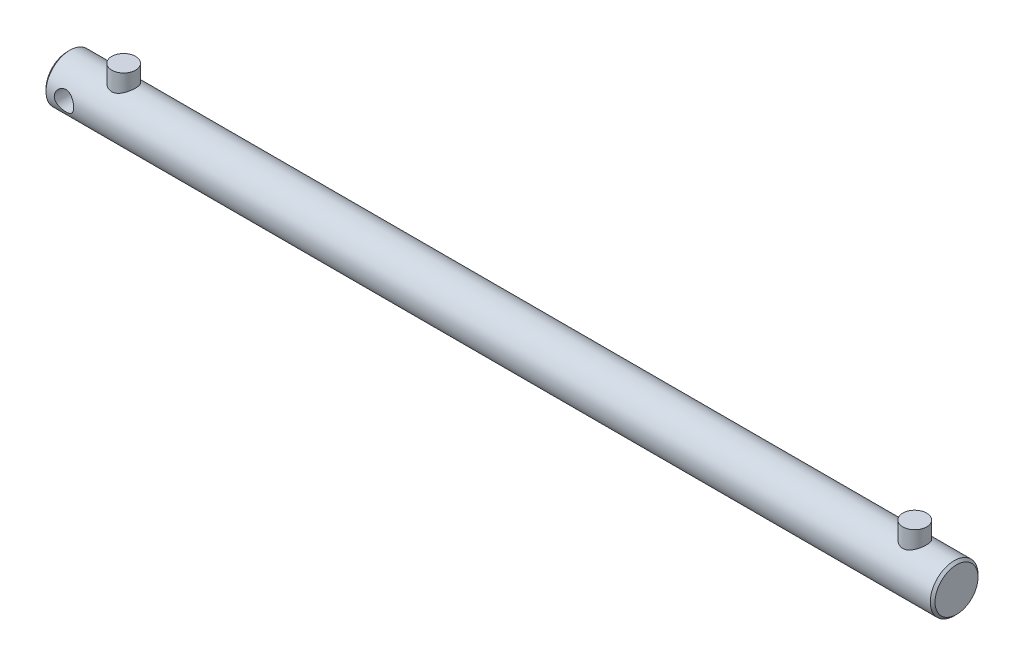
ISO-10303-21;
HEADER;
FILE_DESCRIPTION(('STEP AP214'),'2;1');
FILE_NAME('part.step','',(''),(''),'','','');
FILE_SCHEMA(('AUTOMOTIVE_DESIGN { 1 0 10303 214 1 1 1 1 }'));
ENDSEC;
DATA;
#1=APPLICATION_CONTEXT('core data for automotive mechanical design processes');
#2=APPLICATION_PROTOCOL_DEFINITION('international standard','automotive_design',2000,#1);
#3=PRODUCT_CONTEXT('',#1,'mechanical');
#4=PRODUCT('Part','Part','',(#3));
#5=PRODUCT_RELATED_PRODUCT_CATEGORY('part','',(#4));
#6=PRODUCT_DEFINITION_FORMATION('','',#4);
#7=PRODUCT_DEFINITION_CONTEXT('part definition',#1,'design');
#8=PRODUCT_DEFINITION('design','',#6,#7);
#9=PRODUCT_DEFINITION_SHAPE('','',#8);
#10=(LENGTH_UNIT() NAMED_UNIT(*) SI_UNIT(.MILLI.,.METRE.));
#11=(NAMED_UNIT(*) PLANE_ANGLE_UNIT() SI_UNIT($,.RADIAN.));
#12=(NAMED_UNIT(*) SI_UNIT($,.STERADIAN.) SOLID_ANGLE_UNIT());
#13=UNCERTAINTY_MEASURE_WITH_UNIT(LENGTH_MEASURE(1.E-05),#10,'distance_accuracy_value','');
#14=(GEOMETRIC_REPRESENTATION_CONTEXT(3) GLOBAL_UNCERTAINTY_ASSIGNED_CONTEXT((#13)) GLOBAL_UNIT_ASSIGNED_CONTEXT((#10,
#11,#12)) REPRESENTATION_CONTEXT('',''));
#15=CARTESIAN_POINT('',(0.,0.,0.));
#16=DIRECTION('',(0.,0.,1.));
#17=DIRECTION('',(1.,0.,0.));
#18=AXIS2_PLACEMENT_3D('',#15,#16,#17);
#19=CARTESIAN_POINT('',(-372.,0.,0.));
#20=DIRECTION('',(-1.,0.,0.));
#21=DIRECTION('',(0.,0.,1.));
#22=AXIS2_PLACEMENT_3D('',#19,#20,#21);
#23=CYLINDRICAL_SURFACE('',#22,20.);
#24=CARTESIAN_POINT('',(-325.,17.3205080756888,-10.));
#25=CARTESIAN_POINT('',(-325.260663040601,17.3205095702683,-9.99999887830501));
#26=CARTESIAN_POINT('',(-325.521348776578,17.3264124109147,-9.98979463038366));
#27=CARTESIAN_POINT('',(-326.040711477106,17.3498046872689,-9.94911125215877));
#28=CARTESIAN_POINT('',(-326.299387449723,17.3672995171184,-9.9186226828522));
#29=CARTESIAN_POINT('',(-326.813023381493,17.4132568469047,-9.83771551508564));
#30=CARTESIAN_POINT('',(-327.06797685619,17.4417365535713,-9.7872656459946));
#31=CARTESIAN_POINT('',(-327.572049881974,17.5086546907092,-9.66704369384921));
#32=CARTESIAN_POINT('',(-327.821166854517,17.5470974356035,-9.59726323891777));
#33=CARTESIAN_POINT('',(-328.310473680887,17.6323996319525,-9.43962165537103));
#34=CARTESIAN_POINT('',(-328.550706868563,17.6792090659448,-9.35186754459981));
#35=CARTESIAN_POINT('',(-329.022554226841,17.779982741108,-9.15882440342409));
#36=CARTESIAN_POINT('',(-329.254165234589,17.8339495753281,-9.05352901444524));
#37=CARTESIAN_POINT('',(-329.707545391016,17.9475017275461,-8.82628481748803));
#38=CARTESIAN_POINT('',(-329.929316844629,18.0070857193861,-8.70433993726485));
#39=CARTESIAN_POINT('',(-330.362159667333,18.1303531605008,-8.44458163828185));
#40=CARTESIAN_POINT('',(-330.573230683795,18.1940367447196,-8.30676769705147));
#41=CARTESIAN_POINT('',(-331.000837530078,18.329363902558,-8.00400718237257));
#42=CARTESIAN_POINT('',(-331.216382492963,18.4012302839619,-7.83775940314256));
#43=CARTESIAN_POINT('',(-331.632934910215,18.5460965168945,-7.48852658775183));
#44=CARTESIAN_POINT('',(-331.833946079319,18.6190960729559,-7.30554585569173));
#45=CARTESIAN_POINT('',(-332.220694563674,18.7644955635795,-6.92354675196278));
#46=CARTESIAN_POINT('',(-332.406419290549,18.836894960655,-6.72451542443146));
#47=CARTESIAN_POINT('',(-332.761346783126,18.9792540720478,-6.31154503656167));
#48=CARTESIAN_POINT('',(-332.930555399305,19.0492146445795,-6.09761130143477));
#49=CARTESIAN_POINT('',(-333.262364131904,19.1896470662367,-5.64077435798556));
#50=CARTESIAN_POINT('',(-333.423739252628,19.2598322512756,-5.39689043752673));
#51=CARTESIAN_POINT('',(-333.725206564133,19.3935808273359,-4.89454568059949));
#52=CARTESIAN_POINT('',(-333.865297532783,19.4571438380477,-4.63608400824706));
#53=CARTESIAN_POINT('',(-334.122748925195,19.5757886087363,-4.10635184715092));
#54=CARTESIAN_POINT('',(-334.240120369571,19.6308744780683,-3.83508764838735));
#55=CARTESIAN_POINT('',(-334.450862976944,19.7309453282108,-3.28159286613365));
#56=CARTESIAN_POINT('',(-334.544236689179,19.775931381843,-2.99936345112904));
#57=CARTESIAN_POINT('',(-334.700028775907,19.8516061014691,-2.44661617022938));
#58=CARTESIAN_POINT('',(-334.764176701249,19.8830841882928,-2.1766933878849));
#59=CARTESIAN_POINT('',(-334.869930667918,19.9352303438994,-1.63143316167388));
#60=CARTESIAN_POINT('',(-334.911537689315,19.9558988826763,-1.35609595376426));
#61=CARTESIAN_POINT('',(-334.971639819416,19.9858180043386,-0.802434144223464));
#62=CARTESIAN_POINT('',(-334.990146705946,19.9950744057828,-0.524111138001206));
#63=CARTESIAN_POINT('',(-335.003828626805,20.001913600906,0.0332441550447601));
#64=CARTESIAN_POINT('',(-334.999005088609,19.9994971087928,0.312276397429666));
#65=CARTESIAN_POINT('',(-334.967536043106,19.9837839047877,0.844365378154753));
#66=CARTESIAN_POINT('',(-334.942827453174,19.9714530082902,1.0975680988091));
#67=CARTESIAN_POINT('',(-334.874317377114,19.9374335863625,1.60072224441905));
#68=CARTESIAN_POINT('',(-334.830517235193,19.9157457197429,1.85067389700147));
#69=CARTESIAN_POINT('',(-334.724300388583,19.8635314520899,2.34564683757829));
#70=CARTESIAN_POINT('',(-334.66188307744,19.8330047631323,2.59066796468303));
#71=CARTESIAN_POINT('',(-334.519069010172,19.7638249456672,3.07423071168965));
#72=CARTESIAN_POINT('',(-334.438671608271,19.7251715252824,3.31277209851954));
#73=CARTESIAN_POINT('',(-334.259427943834,19.6400278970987,3.78519130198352));
#74=CARTESIAN_POINT('',(-334.160345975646,19.5934383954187,4.01896179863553));
#75=CARTESIAN_POINT('',(-333.945309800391,19.4938328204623,4.47722728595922));
#76=CARTESIAN_POINT('',(-333.829349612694,19.4408144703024,4.70171895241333));
#77=CARTESIAN_POINT('',(-333.457485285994,19.2738101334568,5.35951935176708));
#78=CARTESIAN_POINT('',(-333.17748838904,19.1518214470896,5.77743819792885));
#79=CARTESIAN_POINT('',(-332.530959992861,18.8844067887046,6.60185513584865));
#80=CARTESIAN_POINT('',(-332.158750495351,18.7378553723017,7.00353936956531));
#81=CARTESIAN_POINT('',(-331.55536158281,18.5185765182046,7.55658054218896));
#82=CARTESIAN_POINT('',(-331.346548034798,18.4455210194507,7.73279224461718));
#83=CARTESIAN_POINT('',(-330.914677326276,18.301419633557,8.06791510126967));
#84=CARTESIAN_POINT('',(-330.691618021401,18.2303740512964,8.2268236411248));
#85=CARTESIAN_POINT('',(-330.217666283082,18.0878347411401,8.53586780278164));
#86=CARTESIAN_POINT('',(-329.965906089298,18.0166021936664,8.68479491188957));
#87=CARTESIAN_POINT('',(-329.448949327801,17.8810231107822,8.96061518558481));
#88=CARTESIAN_POINT('',(-329.183758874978,17.8166734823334,9.08751826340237));
#89=CARTESIAN_POINT('',(-328.64159710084,17.6972138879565,9.3180190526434));
#90=CARTESIAN_POINT('',(-328.364632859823,17.6420984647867,9.42163054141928));
#91=CARTESIAN_POINT('',(-327.800756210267,17.5432965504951,9.60435110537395));
#92=CARTESIAN_POINT('',(-327.513845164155,17.4996085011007,9.68346352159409));
#93=CARTESIAN_POINT('',(-326.955495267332,17.4285246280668,9.81078056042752));
#94=CARTESIAN_POINT('',(-326.684630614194,17.400112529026,9.86093677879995));
#95=CARTESIAN_POINT('',(-326.13867425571,17.355765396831,9.93878416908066));
#96=CARTESIAN_POINT('',(-325.863582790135,17.3398296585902,9.96647661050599));
#97=CARTESIAN_POINT('',(-325.311769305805,17.3211203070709,9.99895720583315));
#98=CARTESIAN_POINT('',(-325.035048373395,17.3183387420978,10.0037591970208));
#99=CARTESIAN_POINT('',(-324.482357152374,17.3260388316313,9.99041751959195));
#100=CARTESIAN_POINT('',(-324.206386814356,17.3365195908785,9.97227539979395));
#101=CARTESIAN_POINT('',(-323.687830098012,17.3684286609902,9.91658048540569));
#102=CARTESIAN_POINT('',(-323.444904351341,17.3885290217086,9.88137691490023));
#103=CARTESIAN_POINT('',(-322.963158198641,17.4382137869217,9.79342893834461));
#104=CARTESIAN_POINT('',(-322.724339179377,17.467801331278,9.7406787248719));
#105=CARTESIAN_POINT('',(-322.25237280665,17.5355331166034,9.61821012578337));
#106=CARTESIAN_POINT('',(-322.019224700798,17.5736762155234,9.54849400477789));
#107=CARTESIAN_POINT('',(-321.55977565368,17.6574071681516,9.39275103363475));
#108=CARTESIAN_POINT('',(-321.33347746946,17.7029979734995,9.30671771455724));
#109=CARTESIAN_POINT('',(-320.646161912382,17.8535843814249,9.01657018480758));
#110=CARTESIAN_POINT('',(-320.19832719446,17.9691397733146,8.78600743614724));
#111=CARTESIAN_POINT('',(-319.34518986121,18.2156365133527,8.26280380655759));
#112=CARTESIAN_POINT('',(-318.93990925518,18.3465857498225,7.9701310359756));
#113=CARTESIAN_POINT('',(-318.344589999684,18.5540860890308,7.46888401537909));
#114=CARTESIAN_POINT('',(-318.137806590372,18.6294365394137,7.27935116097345));
#115=CARTESIAN_POINT('',(-317.740757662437,18.7793184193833,6.88345408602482));
#116=CARTESIAN_POINT('',(-317.550487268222,18.8538500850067,6.6770948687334));
#117=CARTESIAN_POINT('',(-317.18740551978,19.0002370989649,6.24838707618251));
#118=CARTESIAN_POINT('',(-317.014607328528,19.0720904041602,6.02602665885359));
#119=CARTESIAN_POINT('',(-316.687849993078,19.2111944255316,5.56664786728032));
#120=CARTESIAN_POINT('',(-316.533882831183,19.2784470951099,5.32963579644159));
#121=CARTESIAN_POINT('',(-316.2420643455,19.4083463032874,4.83560208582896));
#122=CARTESIAN_POINT('',(-316.104754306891,19.4708214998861,4.57821478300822));
#123=CARTESIAN_POINT('',(-315.852529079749,19.5873354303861,4.05082787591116));
#124=CARTESIAN_POINT('',(-315.737614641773,19.6413738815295,3.78082784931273));
#125=CARTESIAN_POINT('',(-315.531567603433,19.7393769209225,3.23033940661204));
#126=CARTESIAN_POINT('',(-315.440418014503,19.7833487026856,2.94985864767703));
#127=CARTESIAN_POINT('',(-315.282980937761,19.8599022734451,2.38049331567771));
#128=CARTESIAN_POINT('',(-315.216690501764,19.8924854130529,2.09160974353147));
#129=CARTESIAN_POINT('',(-315.114810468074,19.9427983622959,1.53480500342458));
#130=CARTESIAN_POINT('',(-315.076961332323,19.9616170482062,1.26739371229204));
#131=CARTESIAN_POINT('',(-315.023013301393,19.9884894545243,0.729851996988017));
#132=CARTESIAN_POINT('',(-315.006913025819,19.9965438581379,0.459721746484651));
#133=CARTESIAN_POINT('',(-314.996673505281,20.0016629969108,-0.0809759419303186));
#134=CARTESIAN_POINT('',(-315.002527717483,19.998731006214,-0.351543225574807));
#135=CARTESIAN_POINT('',(-315.036105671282,19.9819662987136,-0.890971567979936));
#136=CARTESIAN_POINT('',(-315.063828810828,19.9681338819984,-1.15983267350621));
#137=CARTESIAN_POINT('',(-315.13824007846,19.9312153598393,-1.67605139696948));
#138=CARTESIAN_POINT('',(-315.18355535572,19.9088004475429,-1.92365683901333));
#139=CARTESIAN_POINT('',(-315.292457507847,19.8553300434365,-2.41384547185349));
#140=CARTESIAN_POINT('',(-315.356043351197,19.8242750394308,-2.65642894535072));
#141=CARTESIAN_POINT('',(-315.500847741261,19.7542370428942,-3.13506320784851));
#142=CARTESIAN_POINT('',(-315.582064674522,19.7152547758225,-3.37111459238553));
#143=CARTESIAN_POINT('',(-315.761430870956,19.6302044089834,-3.83546861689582));
#144=CARTESIAN_POINT('',(-315.859586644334,19.5841335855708,-4.06376823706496));
#145=CARTESIAN_POINT('',(-316.076518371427,19.483810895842,-4.52085803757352));
#146=CARTESIAN_POINT('',(-316.1959918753,19.4292950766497,-4.74925902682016));
#147=CARTESIAN_POINT('',(-316.451565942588,19.3148302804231,-5.1952243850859));
#148=CARTESIAN_POINT('',(-316.587672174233,19.2548794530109,-5.41278502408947));
#149=CARTESIAN_POINT('',(-316.875596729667,19.1308402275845,-5.83606045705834));
#150=CARTESIAN_POINT('',(-317.027418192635,19.0667510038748,-6.04177287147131));
#151=CARTESIAN_POINT('',(-317.345875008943,18.9358010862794,-6.44045588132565));
#152=CARTESIAN_POINT('',(-317.5125111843,18.868940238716,-6.63342576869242));
#153=CARTESIAN_POINT('',(-317.877095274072,18.7271146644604,-7.02443076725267));
#154=CARTESIAN_POINT('',(-318.076508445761,18.6520069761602,-7.22105023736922));
#155=CARTESIAN_POINT('',(-318.491110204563,18.5021161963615,-7.59688252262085));
#156=CARTESIAN_POINT('',(-318.706294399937,18.4273330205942,-7.77610015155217));
#157=CARTESIAN_POINT('',(-319.151667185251,18.2800108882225,-8.11637930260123));
#158=CARTESIAN_POINT('',(-319.381870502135,18.2074742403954,-8.27742256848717));
#159=CARTESIAN_POINT('',(-319.856021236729,18.0668000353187,-8.58012843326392));
#160=CARTESIAN_POINT('',(-320.09997058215,17.9986630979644,-8.72178830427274));
#161=CARTESIAN_POINT('',(-320.60837449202,17.8668466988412,-8.98880823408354));
#162=CARTESIAN_POINT('',(-320.873235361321,17.8033795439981,-9.11350193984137));
#163=CARTESIAN_POINT('',(-321.414528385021,17.6857538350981,-9.33972032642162));
#164=CARTESIAN_POINT('',(-321.690954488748,17.6315904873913,-9.4412569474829));
#165=CARTESIAN_POINT('',(-322.252811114,17.5348420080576,-9.61975104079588));
#166=CARTESIAN_POINT('',(-322.538216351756,17.4922271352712,-9.6967717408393));
#167=CARTESIAN_POINT('',(-323.116185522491,17.4202953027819,-9.82541504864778));
#168=CARTESIAN_POINT('',(-323.408744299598,17.3909690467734,-9.87705541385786));
#169=CARTESIAN_POINT('',(-323.917995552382,17.3529508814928,-9.94364603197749));
#170=CARTESIAN_POINT('',(-324.133648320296,17.3408143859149,-9.96475859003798));
#171=CARTESIAN_POINT('',(-324.566195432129,17.3245920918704,-9.99293651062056));
#172=CARTESIAN_POINT('',(-324.783089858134,17.3205068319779,-10.0000009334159));
#173=CARTESIAN_POINT('',(-325.,17.3205080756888,-10.));
#174=B_SPLINE_CURVE_WITH_KNOTS('',3,(#24,#25,#26,#27,#28,#29,#30,#31,#32,#33,#34,#35,#36,#37,
#38,#39,#40,#41,#42,#43,#44,#45,#46,#47,#48,#49,#50,#51,#52,#53,#54,#55,#56,#57,#58,#59,#60,#61,
#62,#63,#64,#65,#66,#67,#68,#69,#70,#71,#72,#73,#74,#75,#76,#77,#78,#79,#80,#81,#82,#83,#84,#85,
#86,#87,#88,#89,#90,#91,#92,#93,#94,#95,#96,#97,#98,#99,#100,#101,#102,#103,#104,#105,#106,#107,
#108,#109,#110,#111,#112,#113,#114,#115,#116,#117,#118,#119,#120,#121,#122,#123,#124,#125,#126,
#127,#128,#129,#130,#131,#132,#133,#134,#135,#136,#137,#138,#139,#140,#141,#142,#143,#144,#145,
#146,#147,#148,#149,#150,#151,#152,#153,#154,#155,#156,#157,#158,#159,#160,#161,#162,#163,#164,
#165,#166,#167,#168,#169,#170,#171,#172,#173),.UNSPECIFIED.,.T.,.F.,(4,2,2,2,2,2,2,2,2,2,2,2,2,
2,2,2,2,2,2,2,2,2,2,2,2,2,2,2,2,2,2,2,2,2,2,2,2,2,2,2,2,2,2,2,2,2,2,2,2,2,2,2,2,2,2,2,2,2,2,2,2,
2,2,2,2,2,2,2,2,2,2,2,2,2,4),(0.,0.781764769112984,1.56389357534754,2.34725251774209,
3.1309512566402,3.91011273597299,4.68955727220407,5.46881824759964,6.24810488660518,
7.09181817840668,7.93531505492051,8.77949974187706,9.62338430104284,10.524458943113,
11.4255853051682,12.3262734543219,13.2268658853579,14.063393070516,14.8998838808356,
15.7359480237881,16.5719610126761,17.3351709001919,18.0983270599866,18.8615080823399,
19.6247165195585,20.3982891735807,21.1721366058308,22.7189130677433,24.4119022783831,
25.2596540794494,26.1075337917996,27.0095657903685,27.9111907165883,28.8122809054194,
29.7132481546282,30.5428616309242,31.372428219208,32.2014932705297,33.0305023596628,
33.7685142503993,34.5067706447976,35.2449285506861,35.9833797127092,37.5272041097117,
39.0718230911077,39.942334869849,40.8125887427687,41.6834934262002,42.554026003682,
43.4478458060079,44.3416955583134,45.2349045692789,46.1280076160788,46.9391312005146,
47.7502033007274,48.5610337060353,49.3718417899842,50.1291222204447,50.8863599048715,
51.6435283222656,52.4009883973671,53.1905472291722,53.9803758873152,54.7703626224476,
55.5603932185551,56.4292490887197,57.2978639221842,58.1673436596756,59.0369456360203,
59.9343645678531,60.8313197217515,61.7259424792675,62.6199384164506,63.2704386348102,
63.9209823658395),.UNSPECIFIED.);
#175=CARTESIAN_POINT('',(-325.,17.3205080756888,-10.));
#176=VERTEX_POINT('',#175);
#177=EDGE_CURVE('E40',#176,#176,#174,.T.);
#178=ORIENTED_EDGE('',*,*,#177,.F.);
#179=EDGE_LOOP('',(#178));
#180=FACE_BOUND('',#179,.T.);
#181=CARTESIAN_POINT('',(-346.9,0.,-20.));
#182=CARTESIAN_POINT('',(-346.900001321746,0.217553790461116,-19.9999989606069));
#183=CARTESIAN_POINT('',(-346.908776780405,0.435188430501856,-19.9964404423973));
#184=CARTESIAN_POINT('',(-346.943798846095,0.868915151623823,-19.9822953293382));
#185=CARTESIAN_POINT('',(-346.970056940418,1.085006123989,-19.9717041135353));
#186=CARTESIAN_POINT('',(-347.039857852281,1.51445060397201,-19.9437418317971));
#187=CARTESIAN_POINT('',(-347.083440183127,1.72779669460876,-19.9263552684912));
#188=CARTESIAN_POINT('',(-347.187452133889,2.14972461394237,-19.8852614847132));
#189=CARTESIAN_POINT('',(-347.247882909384,2.35830611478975,-19.8615538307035));
#190=CARTESIAN_POINT('',(-347.384784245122,2.76859175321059,-19.8085220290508));
#191=CARTESIAN_POINT('',(-347.461199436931,2.97031690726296,-19.7792172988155));
#192=CARTESIAN_POINT('',(-347.629534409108,3.3663843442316,-19.7156711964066));
#193=CARTESIAN_POINT('',(-347.721454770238,3.56072635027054,-19.6814296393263));
#194=CARTESIAN_POINT('',(-347.920016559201,3.94078379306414,-19.6088661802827));
#195=CARTESIAN_POINT('',(-348.026649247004,4.12650426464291,-19.5705467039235));
#196=CARTESIAN_POINT('',(-348.253961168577,4.48850295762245,-19.4907084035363));
#197=CARTESIAN_POINT('',(-348.374645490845,4.66477772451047,-19.4491884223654));
#198=CARTESIAN_POINT('',(-348.63482150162,5.01438229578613,-19.3620718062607));
#199=CARTESIAN_POINT('',(-348.774904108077,5.18724787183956,-19.3163763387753));
#200=CARTESIAN_POINT('',(-349.068619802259,5.52069726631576,-19.2237314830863));
#201=CARTESIAN_POINT('',(-349.222253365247,5.6812806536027,-19.1767820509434));
#202=CARTESIAN_POINT('',(-349.542284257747,5.98938278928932,-19.0827999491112));
#203=CARTESIAN_POINT('',(-349.708689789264,6.1368930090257,-19.0357672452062));
#204=CARTESIAN_POINT('',(-350.053204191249,6.41783459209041,-18.9428953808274));
#205=CARTESIAN_POINT('',(-350.231309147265,6.55127062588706,-18.8970558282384));
#206=CARTESIAN_POINT('',(-350.606840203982,6.80914100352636,-18.8057217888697));
#207=CARTESIAN_POINT('',(-350.804779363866,6.93287030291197,-18.760342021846));
#208=CARTESIAN_POINT('',(-351.21120099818,7.16306636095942,-18.6736608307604));
#209=CARTESIAN_POINT('',(-351.419679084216,7.26954022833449,-18.6323577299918));
#210=CARTESIAN_POINT('',(-351.845884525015,7.4643447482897,-18.555175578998));
#211=CARTESIAN_POINT('',(-352.063610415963,7.55267825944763,-18.5192956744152));
#212=CARTESIAN_POINT('',(-352.506807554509,7.71033713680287,-18.4542132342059));
#213=CARTESIAN_POINT('',(-352.732278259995,7.77966383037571,-18.4250102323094));
#214=CARTESIAN_POINT('',(-353.178677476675,7.8957894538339,-18.3755355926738));
#215=CARTESIAN_POINT('',(-353.399335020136,7.94348076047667,-18.3549138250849));
#216=CARTESIAN_POINT('',(-353.844442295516,8.02032945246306,-18.321464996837));
#217=CARTESIAN_POINT('',(-354.06889191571,8.04948738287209,-18.3086377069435));
#218=CARTESIAN_POINT('',(-354.519666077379,8.08890880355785,-18.2912553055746));
#219=CARTESIAN_POINT('',(-354.745989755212,8.09918055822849,-18.2866965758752));
#220=CARTESIAN_POINT('',(-355.198709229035,8.10072505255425,-18.2860126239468));
#221=CARTESIAN_POINT('',(-355.425105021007,8.09199871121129,-18.2898869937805));
#222=CARTESIAN_POINT('',(-355.859830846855,8.05697039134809,-18.3053422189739));
#223=CARTESIAN_POINT('',(-356.068288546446,8.03197836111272,-18.3163484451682));
#224=CARTESIAN_POINT('',(-356.482250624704,7.96598244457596,-18.3451470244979));
#225=CARTESIAN_POINT('',(-356.687753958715,7.92497303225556,-18.362941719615));
#226=CARTESIAN_POINT('',(-357.094312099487,7.82735937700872,-18.4047618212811));
#227=CARTESIAN_POINT('',(-357.29536798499,7.77075896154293,-18.4287856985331));
#228=CARTESIAN_POINT('',(-357.691918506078,7.6424487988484,-18.4823647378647));
#229=CARTESIAN_POINT('',(-357.887410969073,7.57073323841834,-18.5119220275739));
#230=CARTESIAN_POINT('',(-358.275541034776,7.41119054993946,-18.5763775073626));
#231=CARTESIAN_POINT('',(-358.468040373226,7.32306621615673,-18.6113718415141));
#232=CARTESIAN_POINT('',(-358.845021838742,7.13235218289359,-18.6852885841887));
#233=CARTESIAN_POINT('',(-359.029501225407,7.02975758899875,-18.7242123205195));
#234=CARTESIAN_POINT('',(-359.389462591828,6.81080050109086,-18.8049623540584));
#235=CARTESIAN_POINT('',(-359.564943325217,6.69443610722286,-18.8467890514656));
#236=CARTESIAN_POINT('',(-359.90603190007,6.44864679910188,-18.932297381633));
#237=CARTESIAN_POINT('',(-360.071639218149,6.31922119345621,-18.9759791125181));
#238=CARTESIAN_POINT('',(-360.404955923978,6.03720358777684,-19.0676654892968));
#239=CARTESIAN_POINT('',(-360.571781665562,5.88358742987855,-19.1157372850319));
#240=CARTESIAN_POINT('',(-360.891974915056,5.56290919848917,-19.2115077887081));
#241=CARTESIAN_POINT('',(-361.045346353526,5.39585107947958,-19.2592066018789));
#242=CARTESIAN_POINT('',(-361.337835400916,5.04909074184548,-19.3530089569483));
#243=CARTESIAN_POINT('',(-361.476944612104,4.86938117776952,-19.3991115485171));
#244=CARTESIAN_POINT('',(-361.739815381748,4.49850306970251,-19.4884538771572));
#245=CARTESIAN_POINT('',(-361.86358307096,4.30733914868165,-19.5316947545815));
#246=CARTESIAN_POINT('',(-362.097369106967,3.9104365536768,-19.6150570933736));
#247=CARTESIAN_POINT('',(-362.207039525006,3.704474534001,-19.6550927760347));
#248=CARTESIAN_POINT('',(-362.408471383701,3.28314601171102,-19.729842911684));
#249=CARTESIAN_POINT('',(-362.500240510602,3.06778359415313,-19.7645596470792));
#250=CARTESIAN_POINT('',(-362.665018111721,2.62913934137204,-19.8276753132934));
#251=CARTESIAN_POINT('',(-362.738030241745,2.40585905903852,-19.8560754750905));
#252=CARTESIAN_POINT('',(-362.864528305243,1.95305901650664,-19.9057131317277));
#253=CARTESIAN_POINT('',(-362.918015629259,1.72353970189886,-19.926951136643));
#254=CARTESIAN_POINT('',(-363.002224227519,1.27415358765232,-19.9605660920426));
#255=CARTESIAN_POINT('',(-363.034125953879,1.05454166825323,-19.9734009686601));
#256=CARTESIAN_POINT('',(-363.079807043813,0.613140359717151,-19.9918193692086));
#257=CARTESIAN_POINT('',(-363.093587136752,0.391351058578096,-19.9974031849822));
#258=CARTESIAN_POINT('',(-363.102871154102,-0.0526198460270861,-20.0011625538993));
#259=CARTESIAN_POINT('',(-363.098379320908,-0.274801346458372,-19.9993398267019));
#260=CARTESIAN_POINT('',(-363.071179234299,-0.717859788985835,-19.9883410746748));
#261=CARTESIAN_POINT('',(-363.048471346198,-0.938736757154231,-19.9791651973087));
#262=CARTESIAN_POINT('',(-362.986569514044,-1.36724903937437,-19.954311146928));
#263=CARTESIAN_POINT('',(-362.948192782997,-1.5750219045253,-19.9389557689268));
#264=CARTESIAN_POINT('',(-362.855464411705,-1.98649733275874,-19.9021734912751));
#265=CARTESIAN_POINT('',(-362.801107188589,-2.19019844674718,-19.8807444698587));
#266=CARTESIAN_POINT('',(-362.676934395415,-2.59208434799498,-19.8323487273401));
#267=CARTESIAN_POINT('',(-362.607123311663,-2.79027071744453,-19.8053836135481));
#268=CARTESIAN_POINT('',(-362.452592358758,-3.18006963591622,-19.7465447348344));
#269=CARTESIAN_POINT('',(-362.367866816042,-3.37167964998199,-19.7146691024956));
#270=CARTESIAN_POINT('',(-362.181383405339,-3.75288057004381,-19.6457256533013));
#271=CARTESIAN_POINT('',(-362.079186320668,-3.94223332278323,-19.6085295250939));
#272=CARTESIAN_POINT('',(-361.860392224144,-4.3117445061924,-19.5306049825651));
#273=CARTESIAN_POINT('',(-361.743790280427,-4.4918997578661,-19.4898753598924));
#274=CARTESIAN_POINT('',(-361.496967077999,-4.84203534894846,-19.4058526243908));
#275=CARTESIAN_POINT('',(-361.366743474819,-5.01201392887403,-19.3625590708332));
#276=CARTESIAN_POINT('',(-361.093473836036,-5.34090761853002,-19.2744311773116));
#277=CARTESIAN_POINT('',(-360.95042722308,-5.49982222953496,-19.2295967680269));
#278=CARTESIAN_POINT('',(-360.642171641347,-5.81617801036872,-19.1363810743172));
#279=CARTESIAN_POINT('',(-360.476117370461,-5.97278662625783,-19.0879656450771));
#280=CARTESIAN_POINT('',(-360.131317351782,-6.27149075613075,-18.9919197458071));
#281=CARTESIAN_POINT('',(-359.952575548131,-6.41359074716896,-18.9442890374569));
#282=CARTESIAN_POINT('',(-359.583258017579,-6.68251089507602,-18.8511091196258));
#283=CARTESIAN_POINT('',(-359.392675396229,-6.80932202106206,-18.8055611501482));
#284=CARTESIAN_POINT('',(-359.000949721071,-7.04661740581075,-18.7179373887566));
#285=CARTESIAN_POINT('',(-358.79981115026,-7.15710852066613,-18.6758601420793));
#286=CARTESIAN_POINT('',(-358.385735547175,-7.3621175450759,-18.5960069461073));
#287=CARTESIAN_POINT('',(-358.17268924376,-7.45643666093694,-18.5582861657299));
#288=CARTESIAN_POINT('',(-357.738475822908,-7.62660439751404,-18.4890062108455));
#289=CARTESIAN_POINT('',(-357.517312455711,-7.70246142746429,-18.4574442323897));
#290=CARTESIAN_POINT('',(-357.068484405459,-7.83492790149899,-18.4016053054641));
#291=CARTESIAN_POINT('',(-356.840822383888,-7.89154510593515,-18.3773254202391));
#292=CARTESIAN_POINT('',(-356.380747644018,-7.9848992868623,-18.3369567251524));
#293=CARTESIAN_POINT('',(-356.148335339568,-8.02163798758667,-18.3208672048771));
#294=CARTESIAN_POINT('',(-355.697962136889,-8.0728170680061,-18.2983698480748));
#295=CARTESIAN_POINT('',(-355.480195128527,-8.08869834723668,-18.2913371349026));
#296=CARTESIAN_POINT('',(-355.043982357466,-8.10281912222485,-18.2850864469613));
#297=CARTESIAN_POINT('',(-354.825536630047,-8.10105952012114,-18.2858680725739));
#298=CARTESIAN_POINT('',(-354.389698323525,-8.07992140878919,-18.2952179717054));
#299=CARTESIAN_POINT('',(-354.172305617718,-8.06054507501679,-18.3037852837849));
#300=CARTESIAN_POINT('',(-353.740212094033,-8.00439867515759,-18.3284079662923));
#301=CARTESIAN_POINT('',(-353.525511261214,-7.96762870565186,-18.3444632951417));
#302=CARTESIAN_POINT('',(-353.109281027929,-7.8789942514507,-18.3827003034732));
#303=CARTESIAN_POINT('',(-352.907576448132,-7.8278259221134,-18.4045974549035));
#304=CARTESIAN_POINT('',(-352.509277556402,-7.71034555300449,-18.4541223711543));
#305=CARTESIAN_POINT('',(-352.312685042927,-7.64402826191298,-18.4817521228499));
#306=CARTESIAN_POINT('',(-351.925853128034,-7.49682896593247,-18.5419489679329));
#307=CARTESIAN_POINT('',(-351.735612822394,-7.4159490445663,-18.5745153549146));
#308=CARTESIAN_POINT('',(-351.362404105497,-7.24019743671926,-18.6437243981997));
#309=CARTESIAN_POINT('',(-351.179438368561,-7.14532066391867,-18.6803685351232));
#310=CARTESIAN_POINT('',(-350.811381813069,-6.93634048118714,-18.7590072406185));
#311=CARTESIAN_POINT('',(-350.626782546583,-6.82144138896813,-18.8011888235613));
#312=CARTESIAN_POINT('',(-350.26777997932,-6.57747679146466,-18.8879208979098));
#313=CARTESIAN_POINT('',(-350.093377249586,-6.44841049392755,-18.9324715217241));
#314=CARTESIAN_POINT('',(-349.755596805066,-6.17682899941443,-19.0228091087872));
#315=CARTESIAN_POINT('',(-349.592223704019,-6.03430823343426,-19.0685965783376));
#316=CARTESIAN_POINT('',(-349.277481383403,-5.73669576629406,-19.1602337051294));
#317=CARTESIAN_POINT('',(-349.126108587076,-5.58160783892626,-19.2060833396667));
#318=CARTESIAN_POINT('',(-348.826319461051,-5.24873029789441,-19.2998110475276));
#319=CARTESIAN_POINT('',(-348.678795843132,-5.07011468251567,-19.3476165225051));
#320=CARTESIAN_POINT('',(-348.399354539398,-4.70054560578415,-19.4407090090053));
#321=CARTESIAN_POINT('',(-348.267431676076,-4.50959627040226,-19.4859968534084));
#322=CARTESIAN_POINT('',(-348.020029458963,-4.11631109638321,-19.5728526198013));
#323=CARTESIAN_POINT('',(-347.904562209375,-3.91396702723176,-19.6144177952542));
#324=CARTESIAN_POINT('',(-347.691166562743,-3.49932983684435,-19.6926175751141));
#325=CARTESIAN_POINT('',(-347.593236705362,-3.28703754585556,-19.7292525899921));
#326=CARTESIAN_POINT('',(-347.417418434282,-2.85784311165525,-19.7959350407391));
#327=CARTESIAN_POINT('',(-347.339201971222,-2.64109201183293,-19.8260888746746));
#328=CARTESIAN_POINT('',(-347.20135230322,-2.20096724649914,-19.8797603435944));
#329=CARTESIAN_POINT('',(-347.141717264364,-1.9775942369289,-19.9032786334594));
#330=CARTESIAN_POINT('',(-347.041807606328,-1.526562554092,-19.9429368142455));
#331=CARTESIAN_POINT('',(-347.001481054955,-1.29891710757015,-19.959096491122));
#332=CARTESIAN_POINT('',(-346.94043734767,-0.84071264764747,-19.9836373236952));
#333=CARTESIAN_POINT('',(-346.919705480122,-0.610155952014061,-19.9920243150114));
#334=CARTESIAN_POINT('',(-346.905919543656,-0.31601419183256,-19.9976033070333));
#335=CARTESIAN_POINT('',(-346.903700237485,-0.252837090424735,-19.998501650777));
#336=CARTESIAN_POINT('',(-346.900740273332,-0.12644226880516,-19.9997001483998));
#337=CARTESIAN_POINT('',(-346.89999961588,-0.0632245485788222,-20.0000003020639));
#338=CARTESIAN_POINT('',(-346.9,0.,-20.));
#339=B_SPLINE_CURVE_WITH_KNOTS('',3,(#181,#182,#183,#184,#185,#186,#187,#188,#189,#190,#191,
#192,#193,#194,#195,#196,#197,#198,#199,#200,#201,#202,#203,#204,#205,#206,#207,#208,#209,#210,
#211,#212,#213,#214,#215,#216,#217,#218,#219,#220,#221,#222,#223,#224,#225,#226,#227,#228,#229,
#230,#231,#232,#233,#234,#235,#236,#237,#238,#239,#240,#241,#242,#243,#244,#245,#246,#247,#248,
#249,#250,#251,#252,#253,#254,#255,#256,#257,#258,#259,#260,#261,#262,#263,#264,#265,#266,#267,
#268,#269,#270,#271,#272,#273,#274,#275,#276,#277,#278,#279,#280,#281,#282,#283,#284,#285,#286,
#287,#288,#289,#290,#291,#292,#293,#294,#295,#296,#297,#298,#299,#300,#301,#302,#303,#304,#305,
#306,#307,#308,#309,#310,#311,#312,#313,#314,#315,#316,#317,#318,#319,#320,#321,#322,#323,#324,
#325,#326,#327,#328,#329,#330,#331,#332,#333,#334,#335,#336,#337,#338),.UNSPECIFIED.,.T.,.F.,(4,
2,2,2,2,2,2,2,2,2,2,2,2,2,2,2,2,2,2,2,2,2,2,2,2,2,2,2,2,2,2,2,2,2,2,2,2,2,2,2,2,2,2,2,2,2,2,2,2,
2,2,2,2,2,2,2,2,2,2,2,2,2,2,2,2,2,2,2,2,2,2,2,2,2,2,2,2,2,4),(0.,0.652596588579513,
1.30562240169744,1.96014626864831,2.61471503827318,3.2670529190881,3.91941523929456,
4.57139167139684,5.22360494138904,5.90428093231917,6.58498080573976,7.26612153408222,
7.94703551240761,8.65954656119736,9.37176332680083,10.0838677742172,10.7959224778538,
11.4750993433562,12.1542562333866,12.8331158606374,13.5119426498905,14.1419204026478,
14.7721156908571,15.4021564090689,16.0324398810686,16.6755035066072,17.3187851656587,
17.9621556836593,18.6055602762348,19.3002237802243,19.9946836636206,20.6895501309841,
21.3841380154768,22.0934810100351,22.8025187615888,23.5114182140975,24.2202671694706,
24.8862793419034,25.5522647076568,26.2180954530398,26.8839128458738,27.5187156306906,
28.1537404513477,28.7885811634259,29.4236638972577,30.0780389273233,30.7326386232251,
31.3873511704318,32.042093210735,32.7412878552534,33.440266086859,34.1396551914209,
34.8387496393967,35.5459021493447,36.252731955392,36.9592763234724,37.6657593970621,
38.3202973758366,38.9748018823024,39.6292255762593,40.283645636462,40.9106764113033,
41.5379248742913,42.1650836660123,42.7924709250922,43.4562239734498,44.1200141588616,
44.784080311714,45.4479477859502,46.1567243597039,46.8652650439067,47.5743242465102,
48.2833243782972,48.9796040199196,49.6758149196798,50.3701426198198,51.063948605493,
51.2536033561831,51.4432581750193),.UNSPECIFIED.);
#340=CARTESIAN_POINT('',(-346.9,0.,-20.));
#341=VERTEX_POINT('',#340);
#342=EDGE_CURVE('E44',#341,#341,#339,.T.);
#343=ORIENTED_EDGE('',*,*,#342,.T.);
#344=EDGE_LOOP('',(#343));
#345=FACE_BOUND('',#344,.T.);
#346=CARTESIAN_POINT('',(-346.9,0.,20.));
#347=CARTESIAN_POINT('',(-346.900001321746,-0.217553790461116,19.9999989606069));
#348=CARTESIAN_POINT('',(-346.908776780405,-0.435188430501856,19.9964404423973));
#349=CARTESIAN_POINT('',(-346.943798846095,-0.868915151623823,19.9822953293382));
#350=CARTESIAN_POINT('',(-346.970056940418,-1.085006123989,19.9717041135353));
#351=CARTESIAN_POINT('',(-347.039857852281,-1.51445060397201,19.9437418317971));
#352=CARTESIAN_POINT('',(-347.083440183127,-1.72779669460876,19.9263552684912));
#353=CARTESIAN_POINT('',(-347.187452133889,-2.14972461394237,19.8852614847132));
#354=CARTESIAN_POINT('',(-347.247882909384,-2.35830611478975,19.8615538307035));
#355=CARTESIAN_POINT('',(-347.384784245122,-2.76859175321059,19.8085220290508));
#356=CARTESIAN_POINT('',(-347.461199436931,-2.97031690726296,19.7792172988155));
#357=CARTESIAN_POINT('',(-347.629534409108,-3.3663843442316,19.7156711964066));
#358=CARTESIAN_POINT('',(-347.721454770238,-3.56072635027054,19.6814296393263));
#359=CARTESIAN_POINT('',(-347.920016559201,-3.94078379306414,19.6088661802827));
#360=CARTESIAN_POINT('',(-348.026649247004,-4.12650426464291,19.5705467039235));
#361=CARTESIAN_POINT('',(-348.253961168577,-4.48850295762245,19.4907084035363));
#362=CARTESIAN_POINT('',(-348.374645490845,-4.66477772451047,19.4491884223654));
#363=CARTESIAN_POINT('',(-348.63482150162,-5.01438229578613,19.3620718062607));
#364=CARTESIAN_POINT('',(-348.774904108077,-5.18724787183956,19.3163763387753));
#365=CARTESIAN_POINT('',(-349.068619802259,-5.52069726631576,19.2237314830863));
#366=CARTESIAN_POINT('',(-349.222253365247,-5.6812806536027,19.1767820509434));
#367=CARTESIAN_POINT('',(-349.542284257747,-5.98938278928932,19.0827999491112));
#368=CARTESIAN_POINT('',(-349.708689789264,-6.1368930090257,19.0357672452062));
#369=CARTESIAN_POINT('',(-350.053204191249,-6.41783459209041,18.9428953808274));
#370=CARTESIAN_POINT('',(-350.231309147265,-6.55127062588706,18.8970558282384));
#371=CARTESIAN_POINT('',(-350.606840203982,-6.80914100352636,18.8057217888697));
#372=CARTESIAN_POINT('',(-350.804779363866,-6.93287030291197,18.760342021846));
#373=CARTESIAN_POINT('',(-351.21120099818,-7.16306636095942,18.6736608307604));
#374=CARTESIAN_POINT('',(-351.419679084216,-7.26954022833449,18.6323577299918));
#375=CARTESIAN_POINT('',(-351.845884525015,-7.4643447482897,18.555175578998));
#376=CARTESIAN_POINT('',(-352.063610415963,-7.55267825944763,18.5192956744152));
#377=CARTESIAN_POINT('',(-352.506807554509,-7.71033713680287,18.4542132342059));
#378=CARTESIAN_POINT('',(-352.732278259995,-7.77966383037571,18.4250102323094));
#379=CARTESIAN_POINT('',(-353.178677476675,-7.8957894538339,18.3755355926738));
#380=CARTESIAN_POINT('',(-353.399335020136,-7.94348076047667,18.3549138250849));
#381=CARTESIAN_POINT('',(-353.844442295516,-8.02032945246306,18.321464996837));
#382=CARTESIAN_POINT('',(-354.06889191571,-8.04948738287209,18.3086377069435));
#383=CARTESIAN_POINT('',(-354.519666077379,-8.08890880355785,18.2912553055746));
#384=CARTESIAN_POINT('',(-354.745989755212,-8.09918055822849,18.2866965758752));
#385=CARTESIAN_POINT('',(-355.198709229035,-8.10072505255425,18.2860126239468));
#386=CARTESIAN_POINT('',(-355.425105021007,-8.09199871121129,18.2898869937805));
#387=CARTESIAN_POINT('',(-355.859830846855,-8.05697039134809,18.3053422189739));
#388=CARTESIAN_POINT('',(-356.068288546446,-8.03197836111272,18.3163484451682));
#389=CARTESIAN_POINT('',(-356.482250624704,-7.96598244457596,18.3451470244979));
#390=CARTESIAN_POINT('',(-356.687753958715,-7.92497303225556,18.362941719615));
#391=CARTESIAN_POINT('',(-357.094312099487,-7.82735937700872,18.4047618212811));
#392=CARTESIAN_POINT('',(-357.29536798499,-7.77075896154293,18.4287856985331));
#393=CARTESIAN_POINT('',(-357.691918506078,-7.6424487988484,18.4823647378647));
#394=CARTESIAN_POINT('',(-357.887410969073,-7.57073323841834,18.5119220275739));
#395=CARTESIAN_POINT('',(-358.275541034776,-7.41119054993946,18.5763775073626));
#396=CARTESIAN_POINT('',(-358.468040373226,-7.32306621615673,18.6113718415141));
#397=CARTESIAN_POINT('',(-358.845021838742,-7.13235218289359,18.6852885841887));
#398=CARTESIAN_POINT('',(-359.029501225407,-7.02975758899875,18.7242123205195));
#399=CARTESIAN_POINT('',(-359.389462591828,-6.81080050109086,18.8049623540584));
#400=CARTESIAN_POINT('',(-359.564943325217,-6.69443610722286,18.8467890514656));
#401=CARTESIAN_POINT('',(-359.90603190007,-6.44864679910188,18.932297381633));
#402=CARTESIAN_POINT('',(-360.071639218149,-6.31922119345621,18.9759791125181));
#403=CARTESIAN_POINT('',(-360.404955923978,-6.03720358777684,19.0676654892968));
#404=CARTESIAN_POINT('',(-360.571781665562,-5.88358742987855,19.1157372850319));
#405=CARTESIAN_POINT('',(-360.891974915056,-5.56290919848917,19.2115077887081));
#406=CARTESIAN_POINT('',(-361.045346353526,-5.39585107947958,19.2592066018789));
#407=CARTESIAN_POINT('',(-361.337835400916,-5.04909074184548,19.3530089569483));
#408=CARTESIAN_POINT('',(-361.476944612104,-4.86938117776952,19.3991115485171));
#409=CARTESIAN_POINT('',(-361.739815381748,-4.49850306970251,19.4884538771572));
#410=CARTESIAN_POINT('',(-361.86358307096,-4.30733914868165,19.5316947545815));
#411=CARTESIAN_POINT('',(-362.097369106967,-3.9104365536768,19.6150570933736));
#412=CARTESIAN_POINT('',(-362.207039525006,-3.704474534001,19.6550927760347));
#413=CARTESIAN_POINT('',(-362.408471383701,-3.28314601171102,19.729842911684));
#414=CARTESIAN_POINT('',(-362.500240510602,-3.06778359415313,19.7645596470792));
#415=CARTESIAN_POINT('',(-362.665018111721,-2.62913934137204,19.8276753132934));
#416=CARTESIAN_POINT('',(-362.738030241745,-2.40585905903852,19.8560754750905));
#417=CARTESIAN_POINT('',(-362.864528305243,-1.95305901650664,19.9057131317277));
#418=CARTESIAN_POINT('',(-362.918015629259,-1.72353970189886,19.926951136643));
#419=CARTESIAN_POINT('',(-363.002224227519,-1.27415358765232,19.9605660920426));
#420=CARTESIAN_POINT('',(-363.034125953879,-1.05454166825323,19.9734009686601));
#421=CARTESIAN_POINT('',(-363.079807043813,-0.613140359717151,19.9918193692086));
#422=CARTESIAN_POINT('',(-363.093587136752,-0.391351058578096,19.9974031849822));
#423=CARTESIAN_POINT('',(-363.102871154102,0.0526198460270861,20.0011625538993));
#424=CARTESIAN_POINT('',(-363.098379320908,0.274801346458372,19.9993398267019));
#425=CARTESIAN_POINT('',(-363.071179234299,0.717859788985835,19.9883410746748));
#426=CARTESIAN_POINT('',(-363.048471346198,0.938736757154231,19.9791651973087));
#427=CARTESIAN_POINT('',(-362.986569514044,1.36724903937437,19.954311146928));
#428=CARTESIAN_POINT('',(-362.948192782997,1.5750219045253,19.9389557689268));
#429=CARTESIAN_POINT('',(-362.855464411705,1.98649733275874,19.9021734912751));
#430=CARTESIAN_POINT('',(-362.801107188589,2.19019844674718,19.8807444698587));
#431=CARTESIAN_POINT('',(-362.676934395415,2.59208434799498,19.8323487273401));
#432=CARTESIAN_POINT('',(-362.607123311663,2.79027071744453,19.8053836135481));
#433=CARTESIAN_POINT('',(-362.452592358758,3.18006963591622,19.7465447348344));
#434=CARTESIAN_POINT('',(-362.367866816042,3.37167964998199,19.7146691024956));
#435=CARTESIAN_POINT('',(-362.181383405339,3.75288057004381,19.6457256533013));
#436=CARTESIAN_POINT('',(-362.079186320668,3.94223332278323,19.6085295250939));
#437=CARTESIAN_POINT('',(-361.860392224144,4.3117445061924,19.5306049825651));
#438=CARTESIAN_POINT('',(-361.743790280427,4.4918997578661,19.4898753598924));
#439=CARTESIAN_POINT('',(-361.496967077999,4.84203534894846,19.4058526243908));
#440=CARTESIAN_POINT('',(-361.366743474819,5.01201392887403,19.3625590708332));
#441=CARTESIAN_POINT('',(-361.093473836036,5.34090761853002,19.2744311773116));
#442=CARTESIAN_POINT('',(-360.95042722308,5.49982222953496,19.2295967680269));
#443=CARTESIAN_POINT('',(-360.642171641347,5.81617801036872,19.1363810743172));
#444=CARTESIAN_POINT('',(-360.476117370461,5.97278662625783,19.0879656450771));
#445=CARTESIAN_POINT('',(-360.131317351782,6.27149075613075,18.9919197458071));
#446=CARTESIAN_POINT('',(-359.952575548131,6.41359074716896,18.9442890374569));
#447=CARTESIAN_POINT('',(-359.583258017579,6.68251089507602,18.8511091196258));
#448=CARTESIAN_POINT('',(-359.392675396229,6.80932202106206,18.8055611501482));
#449=CARTESIAN_POINT('',(-359.000949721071,7.04661740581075,18.7179373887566));
#450=CARTESIAN_POINT('',(-358.79981115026,7.15710852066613,18.6758601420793));
#451=CARTESIAN_POINT('',(-358.385735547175,7.3621175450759,18.5960069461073));
#452=CARTESIAN_POINT('',(-358.17268924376,7.45643666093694,18.5582861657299));
#453=CARTESIAN_POINT('',(-357.738475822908,7.62660439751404,18.4890062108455));
#454=CARTESIAN_POINT('',(-357.517312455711,7.70246142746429,18.4574442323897));
#455=CARTESIAN_POINT('',(-357.068484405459,7.83492790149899,18.4016053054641));
#456=CARTESIAN_POINT('',(-356.840822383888,7.89154510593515,18.3773254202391));
#457=CARTESIAN_POINT('',(-356.380747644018,7.9848992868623,18.3369567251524));
#458=CARTESIAN_POINT('',(-356.148335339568,8.02163798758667,18.3208672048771));
#459=CARTESIAN_POINT('',(-355.697962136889,8.0728170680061,18.2983698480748));
#460=CARTESIAN_POINT('',(-355.480195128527,8.08869834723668,18.2913371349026));
#461=CARTESIAN_POINT('',(-355.043982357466,8.10281912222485,18.2850864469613));
#462=CARTESIAN_POINT('',(-354.825536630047,8.10105952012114,18.2858680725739));
#463=CARTESIAN_POINT('',(-354.389698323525,8.07992140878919,18.2952179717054));
#464=CARTESIAN_POINT('',(-354.172305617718,8.06054507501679,18.3037852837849));
#465=CARTESIAN_POINT('',(-353.740212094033,8.00439867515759,18.3284079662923));
#466=CARTESIAN_POINT('',(-353.525511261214,7.96762870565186,18.3444632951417));
#467=CARTESIAN_POINT('',(-353.109281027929,7.8789942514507,18.3827003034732));
#468=CARTESIAN_POINT('',(-352.907576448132,7.8278259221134,18.4045974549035));
#469=CARTESIAN_POINT('',(-352.509277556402,7.71034555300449,18.4541223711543));
#470=CARTESIAN_POINT('',(-352.312685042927,7.64402826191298,18.4817521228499));
#471=CARTESIAN_POINT('',(-351.925853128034,7.49682896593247,18.5419489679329));
#472=CARTESIAN_POINT('',(-351.735612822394,7.4159490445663,18.5745153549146));
#473=CARTESIAN_POINT('',(-351.362404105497,7.24019743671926,18.6437243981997));
#474=CARTESIAN_POINT('',(-351.179438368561,7.14532066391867,18.6803685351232));
#475=CARTESIAN_POINT('',(-350.811381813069,6.93634048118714,18.7590072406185));
#476=CARTESIAN_POINT('',(-350.626782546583,6.82144138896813,18.8011888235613));
#477=CARTESIAN_POINT('',(-350.26777997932,6.57747679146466,18.8879208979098));
#478=CARTESIAN_POINT('',(-350.093377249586,6.44841049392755,18.9324715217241));
#479=CARTESIAN_POINT('',(-349.755596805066,6.17682899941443,19.0228091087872));
#480=CARTESIAN_POINT('',(-349.592223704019,6.03430823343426,19.0685965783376));
#481=CARTESIAN_POINT('',(-349.277481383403,5.73669576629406,19.1602337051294));
#482=CARTESIAN_POINT('',(-349.126108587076,5.58160783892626,19.2060833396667));
#483=CARTESIAN_POINT('',(-348.826319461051,5.24873029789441,19.2998110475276));
#484=CARTESIAN_POINT('',(-348.678795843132,5.07011468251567,19.3476165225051));
#485=CARTESIAN_POINT('',(-348.399354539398,4.70054560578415,19.4407090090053));
#486=CARTESIAN_POINT('',(-348.267431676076,4.50959627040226,19.4859968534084));
#487=CARTESIAN_POINT('',(-348.020029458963,4.11631109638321,19.5728526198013));
#488=CARTESIAN_POINT('',(-347.904562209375,3.91396702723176,19.6144177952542));
#489=CARTESIAN_POINT('',(-347.691166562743,3.49932983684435,19.6926175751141));
#490=CARTESIAN_POINT('',(-347.593236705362,3.28703754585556,19.7292525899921));
#491=CARTESIAN_POINT('',(-347.417418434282,2.85784311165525,19.7959350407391));
#492=CARTESIAN_POINT('',(-347.339201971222,2.64109201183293,19.8260888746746));
#493=CARTESIAN_POINT('',(-347.20135230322,2.20096724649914,19.8797603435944));
#494=CARTESIAN_POINT('',(-347.141717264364,1.9775942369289,19.9032786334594));
#495=CARTESIAN_POINT('',(-347.041807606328,1.526562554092,19.9429368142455));
#496=CARTESIAN_POINT('',(-347.001481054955,1.29891710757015,19.959096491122));
#497=CARTESIAN_POINT('',(-346.94043734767,0.84071264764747,19.9836373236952));
#498=CARTESIAN_POINT('',(-346.919705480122,0.610155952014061,19.9920243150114));
#499=CARTESIAN_POINT('',(-346.905919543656,0.31601419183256,19.9976033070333));
#500=CARTESIAN_POINT('',(-346.903700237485,0.252837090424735,19.998501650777));
#501=CARTESIAN_POINT('',(-346.900740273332,0.12644226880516,19.9997001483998));
#502=CARTESIAN_POINT('',(-346.89999961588,0.0632245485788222,20.0000003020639));
#503=CARTESIAN_POINT('',(-346.9,0.,20.));
#504=B_SPLINE_CURVE_WITH_KNOTS('',3,(#346,#347,#348,#349,#350,#351,#352,#353,#354,#355,#356,
#357,#358,#359,#360,#361,#362,#363,#364,#365,#366,#367,#368,#369,#370,#371,#372,#373,#374,#375,
#376,#377,#378,#379,#380,#381,#382,#383,#384,#385,#386,#387,#388,#389,#390,#391,#392,#393,#394,
#395,#396,#397,#398,#399,#400,#401,#402,#403,#404,#405,#406,#407,#408,#409,#410,#411,#412,#413,
#414,#415,#416,#417,#418,#419,#420,#421,#422,#423,#424,#425,#426,#427,#428,#429,#430,#431,#432,
#433,#434,#435,#436,#437,#438,#439,#440,#441,#442,#443,#444,#445,#446,#447,#448,#449,#450,#451,
#452,#453,#454,#455,#456,#457,#458,#459,#460,#461,#462,#463,#464,#465,#466,#467,#468,#469,#470,
#471,#472,#473,#474,#475,#476,#477,#478,#479,#480,#481,#482,#483,#484,#485,#486,#487,#488,#489,
#490,#491,#492,#493,#494,#495,#496,#497,#498,#499,#500,#501,#502,#503),.UNSPECIFIED.,.T.,.F.,(4,
2,2,2,2,2,2,2,2,2,2,2,2,2,2,2,2,2,2,2,2,2,2,2,2,2,2,2,2,2,2,2,2,2,2,2,2,2,2,2,2,2,2,2,2,2,2,2,2,
2,2,2,2,2,2,2,2,2,2,2,2,2,2,2,2,2,2,2,2,2,2,2,2,2,2,2,2,2,4),(0.,0.652596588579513,
1.30562240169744,1.96014626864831,2.61471503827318,3.2670529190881,3.91941523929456,
4.57139167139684,5.22360494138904,5.90428093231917,6.58498080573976,7.26612153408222,
7.94703551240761,8.65954656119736,9.37176332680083,10.0838677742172,10.7959224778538,
11.4750993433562,12.1542562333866,12.8331158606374,13.5119426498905,14.1419204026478,
14.7721156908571,15.4021564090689,16.0324398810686,16.6755035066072,17.3187851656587,
17.9621556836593,18.6055602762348,19.3002237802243,19.9946836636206,20.6895501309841,
21.3841380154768,22.0934810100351,22.8025187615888,23.5114182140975,24.2202671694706,
24.8862793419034,25.5522647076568,26.2180954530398,26.8839128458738,27.5187156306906,
28.1537404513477,28.7885811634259,29.4236638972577,30.0780389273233,30.7326386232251,
31.3873511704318,32.042093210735,32.7412878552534,33.440266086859,34.1396551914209,
34.8387496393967,35.5459021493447,36.252731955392,36.9592763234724,37.6657593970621,
38.3202973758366,38.9748018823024,39.6292255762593,40.283645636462,40.9106764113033,
41.5379248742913,42.1650836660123,42.7924709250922,43.4562239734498,44.1200141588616,
44.784080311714,45.4479477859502,46.1567243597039,46.8652650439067,47.5743242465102,
48.2833243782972,48.9796040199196,49.6758149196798,50.3701426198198,51.063948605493,
51.2536033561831,51.4432581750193),.UNSPECIFIED.);
#505=CARTESIAN_POINT('',(-346.9,0.,20.));
#506=VERTEX_POINT('',#505);
#507=EDGE_CURVE('E48',#506,#506,#504,.T.);
#508=ORIENTED_EDGE('',*,*,#507,.T.);
#509=EDGE_LOOP('',(#508));
#510=FACE_BOUND('',#509,.T.);
#511=CARTESIAN_POINT('',(370.,0.,0.));
#512=DIRECTION('',(-1.,0.,0.));
#513=DIRECTION('',(0.,0.,1.));
#514=AXIS2_PLACEMENT_3D('',#511,#512,#513);
#515=CIRCLE('',#514,20.);
#516=CARTESIAN_POINT('',(370.,0.,20.));
#517=VERTEX_POINT('',#516);
#518=EDGE_CURVE('E82',#517,#517,#515,.T.);
#519=ORIENTED_EDGE('',*,*,#518,.T.);
#520=EDGE_LOOP('',(#519));
#521=FACE_BOUND('',#520,.T.);
#522=CARTESIAN_POINT('',(-370.,0.,0.));
#523=DIRECTION('',(1.,0.,0.));
#524=DIRECTION('',(0.,0.,-1.));
#525=AXIS2_PLACEMENT_3D('',#522,#523,#524);
#526=CIRCLE('',#525,20.);
#527=CARTESIAN_POINT('',(-370.,0.,-20.));
#528=VERTEX_POINT('',#527);
#529=EDGE_CURVE('E85',#528,#528,#526,.T.);
#530=ORIENTED_EDGE('',*,*,#529,.T.);
#531=EDGE_LOOP('',(#530));
#532=FACE_BOUND('',#531,.T.);
#533=CARTESIAN_POINT('',(337.,17.3205080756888,-9.99999999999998));
#534=CARTESIAN_POINT('',(336.739336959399,17.3205095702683,-9.99999887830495));
#535=CARTESIAN_POINT('',(336.478651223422,17.3264124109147,-9.98979463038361));
#536=CARTESIAN_POINT('',(335.959288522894,17.3498046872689,-9.94911125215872));
#537=CARTESIAN_POINT('',(335.700612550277,17.3672995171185,-9.91862268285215));
#538=CARTESIAN_POINT('',(335.186976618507,17.4132568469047,-9.83771551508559));
#539=CARTESIAN_POINT('',(334.93202314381,17.4417365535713,-9.78726564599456));
#540=CARTESIAN_POINT('',(334.427950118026,17.5086546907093,-9.66704369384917));
#541=CARTESIAN_POINT('',(334.178833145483,17.5470974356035,-9.59726323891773));
#542=CARTESIAN_POINT('',(333.689526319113,17.6323996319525,-9.439621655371));
#543=CARTESIAN_POINT('',(333.449293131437,17.6792090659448,-9.35186754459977));
#544=CARTESIAN_POINT('',(332.977445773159,17.779982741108,-9.15882440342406));
#545=CARTESIAN_POINT('',(332.745834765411,17.8339495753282,-9.05352901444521));
#546=CARTESIAN_POINT('',(332.292454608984,17.9475017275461,-8.826284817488));
#547=CARTESIAN_POINT('',(332.070683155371,18.0070857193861,-8.70433993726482));
#548=CARTESIAN_POINT('',(331.637840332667,18.1303531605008,-8.44458163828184));
#549=CARTESIAN_POINT('',(331.426769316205,18.1940367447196,-8.30676769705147));
#550=CARTESIAN_POINT('',(330.999162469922,18.329363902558,-8.00400718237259));
#551=CARTESIAN_POINT('',(330.783617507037,18.4012302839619,-7.83775940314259));
#552=CARTESIAN_POINT('',(330.367065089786,18.5460965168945,-7.48852658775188));
#553=CARTESIAN_POINT('',(330.166053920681,18.6190960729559,-7.30554585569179));
#554=CARTESIAN_POINT('',(329.779305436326,18.7644955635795,-6.92354675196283));
#555=CARTESIAN_POINT('',(329.593580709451,18.836894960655,-6.7245154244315));
#556=CARTESIAN_POINT('',(329.238653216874,18.9792540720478,-6.31154503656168));
#557=CARTESIAN_POINT('',(329.069444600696,19.0492146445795,-6.09761130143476));
#558=CARTESIAN_POINT('',(328.737635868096,19.1896470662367,-5.64077435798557));
#559=CARTESIAN_POINT('',(328.576260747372,19.2598322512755,-5.39689043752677));
#560=CARTESIAN_POINT('',(328.274793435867,19.3935808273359,-4.89454568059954));
#561=CARTESIAN_POINT('',(328.134702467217,19.4571438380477,-4.63608400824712));
#562=CARTESIAN_POINT('',(327.877251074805,19.5757886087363,-4.10635184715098));
#563=CARTESIAN_POINT('',(327.759879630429,19.6308744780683,-3.83508764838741));
#564=CARTESIAN_POINT('',(327.549137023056,19.7309453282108,-3.28159286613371));
#565=CARTESIAN_POINT('',(327.455763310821,19.775931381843,-2.99936345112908));
#566=CARTESIAN_POINT('',(327.299971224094,19.8516061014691,-2.44661617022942));
#567=CARTESIAN_POINT('',(327.235823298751,19.8830841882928,-2.17669338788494));
#568=CARTESIAN_POINT('',(327.130069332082,19.9352303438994,-1.63143316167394));
#569=CARTESIAN_POINT('',(327.088462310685,19.9558988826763,-1.35609595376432));
#570=CARTESIAN_POINT('',(327.028360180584,19.9858180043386,-0.802434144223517));
#571=CARTESIAN_POINT('',(327.009853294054,19.9950744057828,-0.52411113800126));
#572=CARTESIAN_POINT('',(326.996171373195,20.001913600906,0.033244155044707));
#573=CARTESIAN_POINT('',(327.000994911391,19.9994971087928,0.312276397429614));
#574=CARTESIAN_POINT('',(327.032463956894,19.9837839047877,0.8443653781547));
#575=CARTESIAN_POINT('',(327.057172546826,19.9714530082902,1.09756809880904));
#576=CARTESIAN_POINT('',(327.125682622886,19.9374335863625,1.60072224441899));
#577=CARTESIAN_POINT('',(327.169482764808,19.9157457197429,1.8506738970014));
#578=CARTESIAN_POINT('',(327.275699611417,19.8635314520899,2.34564683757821));
#579=CARTESIAN_POINT('',(327.33811692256,19.8330047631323,2.59066796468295));
#580=CARTESIAN_POINT('',(327.480930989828,19.7638249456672,3.07423071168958));
#581=CARTESIAN_POINT('',(327.561328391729,19.7251715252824,3.31277209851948));
#582=CARTESIAN_POINT('',(327.740572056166,19.6400278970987,3.78519130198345));
#583=CARTESIAN_POINT('',(327.839654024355,19.5934383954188,4.01896179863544));
#584=CARTESIAN_POINT('',(328.054690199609,19.4938328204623,4.47722728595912));
#585=CARTESIAN_POINT('',(328.170650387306,19.4408144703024,4.70171895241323));
#586=CARTESIAN_POINT('',(328.542514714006,19.2738101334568,5.35951935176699));
#587=CARTESIAN_POINT('',(328.82251161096,19.1518214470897,5.77743819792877));
#588=CARTESIAN_POINT('',(329.469040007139,18.8844067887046,6.60185513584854));
#589=CARTESIAN_POINT('',(329.841249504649,18.7378553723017,7.00353936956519));
#590=CARTESIAN_POINT('',(330.44463841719,18.5185765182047,7.55658054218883));
#591=CARTESIAN_POINT('',(330.653451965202,18.4455210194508,7.73279224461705));
#592=CARTESIAN_POINT('',(331.085322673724,18.301419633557,8.06791510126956));
#593=CARTESIAN_POINT('',(331.308381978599,18.2303740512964,8.22682364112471));
#594=CARTESIAN_POINT('',(331.782333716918,18.0878347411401,8.53586780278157));
#595=CARTESIAN_POINT('',(332.034093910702,18.0166021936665,8.68479491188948));
#596=CARTESIAN_POINT('',(332.551050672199,17.8810231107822,8.96061518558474));
#597=CARTESIAN_POINT('',(332.816241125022,17.8166734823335,9.0875182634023));
#598=CARTESIAN_POINT('',(333.35840289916,17.6972138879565,9.31801905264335));
#599=CARTESIAN_POINT('',(333.635367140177,17.6420984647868,9.42163054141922));
#600=CARTESIAN_POINT('',(334.199243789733,17.5432965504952,9.60435110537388));
#601=CARTESIAN_POINT('',(334.486154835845,17.4996085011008,9.68346352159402));
#602=CARTESIAN_POINT('',(335.044504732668,17.4285246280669,9.81078056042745));
#603=CARTESIAN_POINT('',(335.315369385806,17.400112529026,9.86093677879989));
#604=CARTESIAN_POINT('',(335.86132574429,17.3557653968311,9.9387841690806));
#605=CARTESIAN_POINT('',(336.136417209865,17.3398296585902,9.96647661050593));
#606=CARTESIAN_POINT('',(336.688230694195,17.3211203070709,9.9989572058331));
#607=CARTESIAN_POINT('',(336.964951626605,17.3183387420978,10.0037591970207));
#608=CARTESIAN_POINT('',(337.517642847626,17.3260388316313,9.9904175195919));
#609=CARTESIAN_POINT('',(337.793613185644,17.3365195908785,9.9722753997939));
#610=CARTESIAN_POINT('',(338.312169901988,17.3684286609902,9.91658048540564));
#611=CARTESIAN_POINT('',(338.555095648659,17.3885290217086,9.88137691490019));
#612=CARTESIAN_POINT('',(339.036841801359,17.4382137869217,9.79342893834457));
#613=CARTESIAN_POINT('',(339.275660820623,17.467801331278,9.74067872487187));
#614=CARTESIAN_POINT('',(339.74762719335,17.5355331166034,9.61821012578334));
#615=CARTESIAN_POINT('',(339.980775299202,17.5736762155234,9.54849400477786));
#616=CARTESIAN_POINT('',(340.44022434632,17.6574071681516,9.39275103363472));
#617=CARTESIAN_POINT('',(340.66652253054,17.7029979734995,9.3067177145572));
#618=CARTESIAN_POINT('',(341.353838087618,17.8535843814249,9.01657018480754));
#619=CARTESIAN_POINT('',(341.80167280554,17.9691397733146,8.7860074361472));
#620=CARTESIAN_POINT('',(342.65481013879,18.2156365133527,8.26280380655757));
#621=CARTESIAN_POINT('',(343.06009074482,18.3465857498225,7.97013103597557));
#622=CARTESIAN_POINT('',(343.655410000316,18.5540860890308,7.46888401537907));
#623=CARTESIAN_POINT('',(343.862193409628,18.6294365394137,7.27935116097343));
#624=CARTESIAN_POINT('',(344.259242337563,18.7793184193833,6.8834540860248));
#625=CARTESIAN_POINT('',(344.449512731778,18.8538500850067,6.67709486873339));
#626=CARTESIAN_POINT('',(344.81259448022,19.0002370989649,6.2483870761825));
#627=CARTESIAN_POINT('',(344.985392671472,19.0720904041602,6.02602665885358));
#628=CARTESIAN_POINT('',(345.312150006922,19.2111944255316,5.56664786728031));
#629=CARTESIAN_POINT('',(345.466117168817,19.2784470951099,5.32963579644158));
#630=CARTESIAN_POINT('',(345.7579356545,19.4083463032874,4.83560208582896));
#631=CARTESIAN_POINT('',(345.895245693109,19.4708214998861,4.57821478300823));
#632=CARTESIAN_POINT('',(346.147470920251,19.5873354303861,4.05082787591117));
#633=CARTESIAN_POINT('',(346.262385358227,19.6413738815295,3.78082784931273));
#634=CARTESIAN_POINT('',(346.468432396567,19.7393769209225,3.23033940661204));
#635=CARTESIAN_POINT('',(346.559581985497,19.7833487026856,2.94985864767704));
#636=CARTESIAN_POINT('',(346.717019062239,19.8599022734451,2.38049331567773));
#637=CARTESIAN_POINT('',(346.783309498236,19.8924854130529,2.09160974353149));
#638=CARTESIAN_POINT('',(346.885189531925,19.9427983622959,1.5348050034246));
#639=CARTESIAN_POINT('',(346.923038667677,19.9616170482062,1.26739371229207));
#640=CARTESIAN_POINT('',(346.976986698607,19.9884894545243,0.729851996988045));
#641=CARTESIAN_POINT('',(346.993086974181,19.9965438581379,0.459721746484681));
#642=CARTESIAN_POINT('',(347.003326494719,20.0016629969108,-0.0809759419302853));
#643=CARTESIAN_POINT('',(346.997472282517,19.998731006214,-0.351543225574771));
#644=CARTESIAN_POINT('',(346.963894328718,19.9819662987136,-0.890971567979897));
#645=CARTESIAN_POINT('',(346.936171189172,19.9681338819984,-1.15983267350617));
#646=CARTESIAN_POINT('',(346.86175992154,19.9312153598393,-1.67605139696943));
#647=CARTESIAN_POINT('',(346.81644464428,19.9088004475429,-1.92365683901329));
#648=CARTESIAN_POINT('',(346.707542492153,19.8553300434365,-2.41384547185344));
#649=CARTESIAN_POINT('',(346.643956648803,19.8242750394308,-2.65642894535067));
#650=CARTESIAN_POINT('',(346.499152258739,19.7542370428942,-3.13506320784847));
#651=CARTESIAN_POINT('',(346.417935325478,19.7152547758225,-3.37111459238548));
#652=CARTESIAN_POINT('',(346.238569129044,19.6302044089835,-3.83546861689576));
#653=CARTESIAN_POINT('',(346.140413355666,19.5841335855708,-4.06376823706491));
#654=CARTESIAN_POINT('',(345.923481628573,19.483810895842,-4.52085803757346));
#655=CARTESIAN_POINT('',(345.8040081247,19.4292950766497,-4.74925902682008));
#656=CARTESIAN_POINT('',(345.548434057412,19.3148302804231,-5.19522438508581));
#657=CARTESIAN_POINT('',(345.412327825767,19.2548794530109,-5.4127850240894));
#658=CARTESIAN_POINT('',(345.124403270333,19.1308402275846,-5.83606045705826));
#659=CARTESIAN_POINT('',(344.972581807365,19.0667510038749,-6.04177287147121));
#660=CARTESIAN_POINT('',(344.654124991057,18.9358010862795,-6.44045588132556));
#661=CARTESIAN_POINT('',(344.4874888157,18.8689402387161,-6.63342576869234));
#662=CARTESIAN_POINT('',(344.122904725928,18.7271146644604,-7.0244307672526));
#663=CARTESIAN_POINT('',(343.923491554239,18.6520069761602,-7.22105023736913));
#664=CARTESIAN_POINT('',(343.508889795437,18.5021161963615,-7.59688252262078));
#665=CARTESIAN_POINT('',(343.293705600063,18.4273330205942,-7.77610015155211));
#666=CARTESIAN_POINT('',(342.848332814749,18.2800108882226,-8.11637930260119));
#667=CARTESIAN_POINT('',(342.618129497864,18.2074742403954,-8.27742256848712));
#668=CARTESIAN_POINT('',(342.143978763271,18.0668000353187,-8.58012843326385));
#669=CARTESIAN_POINT('',(341.90002941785,17.9986630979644,-8.72178830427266));
#670=CARTESIAN_POINT('',(341.39162550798,17.8668466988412,-8.98880823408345));
#671=CARTESIAN_POINT('',(341.126764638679,17.8033795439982,-9.11350193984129));
#672=CARTESIAN_POINT('',(340.585471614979,17.6857538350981,-9.33972032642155));
#673=CARTESIAN_POINT('',(340.309045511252,17.6315904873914,-9.44125694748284));
#674=CARTESIAN_POINT('',(339.747188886,17.5348420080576,-9.61975104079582));
#675=CARTESIAN_POINT('',(339.461783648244,17.4922271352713,-9.69677174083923));
#676=CARTESIAN_POINT('',(338.883814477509,17.420295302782,-9.82541504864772));
#677=CARTESIAN_POINT('',(338.591255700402,17.3909690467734,-9.8770554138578));
#678=CARTESIAN_POINT('',(338.082004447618,17.3529508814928,-9.94364603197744));
#679=CARTESIAN_POINT('',(337.866351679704,17.340814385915,-9.96475859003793));
#680=CARTESIAN_POINT('',(337.433804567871,17.3245920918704,-9.99293651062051));
#681=CARTESIAN_POINT('',(337.216910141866,17.3205068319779,-10.0000009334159));
#682=CARTESIAN_POINT('',(337.,17.3205080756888,-9.99999999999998));
#683=B_SPLINE_CURVE_WITH_KNOTS('',3,(#533,#534,#535,#536,#537,#538,#539,#540,#541,#542,#543,
#544,#545,#546,#547,#548,#549,#550,#551,#552,#553,#554,#555,#556,#557,#558,#559,#560,#561,#562,
#563,#564,#565,#566,#567,#568,#569,#570,#571,#572,#573,#574,#575,#576,#577,#578,#579,#580,#581,
#582,#583,#584,#585,#586,#587,#588,#589,#590,#591,#592,#593,#594,#595,#596,#597,#598,#599,#600,
#601,#602,#603,#604,#605,#606,#607,#608,#609,#610,#611,#612,#613,#614,#615,#616,#617,#618,#619,
#620,#621,#622,#623,#624,#625,#626,#627,#628,#629,#630,#631,#632,#633,#634,#635,#636,#637,#638,
#639,#640,#641,#642,#643,#644,#645,#646,#647,#648,#649,#650,#651,#652,#653,#654,#655,#656,#657,
#658,#659,#660,#661,#662,#663,#664,#665,#666,#667,#668,#669,#670,#671,#672,#673,#674,#675,#676,
#677,#678,#679,#680,#681,#682),.UNSPECIFIED.,.T.,.F.,(4,2,2,2,2,2,2,2,2,2,2,2,2,2,2,2,2,2,2,2,2,
2,2,2,2,2,2,2,2,2,2,2,2,2,2,2,2,2,2,2,2,2,2,2,2,2,2,2,2,2,2,2,2,2,2,2,2,2,2,2,2,2,2,2,2,2,2,2,2,
2,2,2,2,2,4),(0.,0.781764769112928,1.56389357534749,2.34725251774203,3.13095125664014,
3.91011273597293,4.68955727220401,5.46881824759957,6.24810488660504,7.09181817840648,
7.93531505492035,8.77949974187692,9.62338430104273,10.5244589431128,11.4255853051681,
12.3262734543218,13.2268658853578,14.0633930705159,14.8998838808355,15.735948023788,
16.5719610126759,17.3351709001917,18.0983270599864,18.8615080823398,19.6247165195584,
20.3982891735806,21.1721366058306,22.7189130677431,24.4119022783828,25.2596540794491,
26.1075337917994,27.0095657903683,27.9111907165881,28.8122809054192,29.713248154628,
30.5428616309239,31.3724282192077,32.2014932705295,33.0305023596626,33.7685142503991,
34.5067706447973,35.2449285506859,35.983379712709,37.5272041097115,39.0718230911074,
39.9423348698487,40.8125887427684,41.6834934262,42.5540260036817,43.4478458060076,
44.3416955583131,45.2349045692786,46.1280076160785,46.9391312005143,47.7502033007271,
48.561033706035,49.3718417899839,50.1291222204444,50.8863599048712,51.6435283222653,
52.4009883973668,53.1905472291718,53.9803758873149,54.7703626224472,55.5603932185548,
56.4292490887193,57.2978639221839,58.1673436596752,59.0369456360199,59.9343645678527,
60.8313197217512,61.7259424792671,62.6199384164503,63.2704386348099,63.9209823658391),.UNSPECIFIED.);
#684=CARTESIAN_POINT('',(337.,17.3205080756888,-9.99999999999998));
#685=VERTEX_POINT('',#684);
#686=EDGE_CURVE('E10',#685,#685,#683,.T.);
#687=ORIENTED_EDGE('',*,*,#686,.F.);
#688=EDGE_LOOP('',(#687));
#689=FACE_BOUND('',#688,.T.);
#690=ADVANCED_FACE('F29',(#180,#345,#510,#521,#532,#689),#23,.T.);
#691=CARTESIAN_POINT('',(-372.,0.,0.));
#692=DIRECTION('',(1.,0.,0.));
#693=DIRECTION('',(0.,0.,-1.));
#694=AXIS2_PLACEMENT_3D('',#691,#692,#693);
#695=PLANE('',#694);
#696=CARTESIAN_POINT('',(-372.,0.,0.));
#697=DIRECTION('',(1.,0.,0.));
#698=DIRECTION('',(0.,0.,-1.));
#699=AXIS2_PLACEMENT_3D('',#696,#697,#698);
#700=CIRCLE('',#699,18.);
#701=CARTESIAN_POINT('',(-372.,0.,-18.));
#702=VERTEX_POINT('',#701);
#703=EDGE_CURVE('E76',#702,#702,#700,.F.);
#704=ORIENTED_EDGE('',*,*,#703,.T.);
#705=EDGE_LOOP('',(#704));
#706=FACE_BOUND('',#705,.T.);
#707=ADVANCED_FACE('F107',(#706),#695,.F.);
#708=CARTESIAN_POINT('',(372.,20.,0.));
#709=DIRECTION('',(-1.,0.,0.));
#710=DIRECTION('',(0.,0.,1.));
#711=AXIS2_PLACEMENT_3D('',#708,#709,#710);
#712=PLANE('',#711);
#713=CARTESIAN_POINT('',(372.,0.,0.));
#714=DIRECTION('',(-1.,0.,0.));
#715=DIRECTION('',(0.,0.,1.));
#716=AXIS2_PLACEMENT_3D('',#713,#714,#715);
#717=CIRCLE('',#716,17.9999999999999);
#718=CARTESIAN_POINT('',(372.,0.,17.9999999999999));
#719=VERTEX_POINT('',#718);
#720=EDGE_CURVE('E79',#719,#719,#717,.F.);
#721=ORIENTED_EDGE('',*,*,#720,.T.);
#722=EDGE_LOOP('',(#721));
#723=FACE_BOUND('',#722,.T.);
#724=ADVANCED_FACE('F70',(#723),#712,.F.);
#725=CARTESIAN_POINT('',(370.,0.,0.));
#726=DIRECTION('',(-1.,0.,0.));
#727=DIRECTION('',(0.,0.,1.));
#728=AXIS2_PLACEMENT_3D('',#725,#726,#727);
#729=CONICAL_SURFACE('',#728,20.,0.785398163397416);
#730=ORIENTED_EDGE('',*,*,#720,.F.);
#731=EDGE_LOOP('',(#730));
#732=FACE_BOUND('',#731,.T.);
#733=ORIENTED_EDGE('',*,*,#518,.F.);
#734=EDGE_LOOP('',(#733));
#735=FACE_BOUND('',#734,.T.);
#736=ADVANCED_FACE('F125',(#732,#735),#729,.T.);
#737=CARTESIAN_POINT('',(-372.,0.,0.));
#738=DIRECTION('',(1.,0.,0.));
#739=DIRECTION('',(0.,0.,-1.));
#740=AXIS2_PLACEMENT_3D('',#737,#738,#739);
#741=CONICAL_SURFACE('',#740,18.,0.785398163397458);
#742=ORIENTED_EDGE('',*,*,#529,.F.);
#743=EDGE_LOOP('',(#742));
#744=FACE_BOUND('',#743,.T.);
#745=ORIENTED_EDGE('',*,*,#703,.F.);
#746=EDGE_LOOP('',(#745));
#747=FACE_BOUND('',#746,.T.);
#748=ADVANCED_FACE('F31',(#744,#747),#741,.T.);
#749=CARTESIAN_POINT('',(-355.,0.,-20.));
#750=DIRECTION('',(0.,0.,1.));
#751=DIRECTION('',(1.,0.,0.));
#752=AXIS2_PLACEMENT_3D('',#749,#750,#751);
#753=CYLINDRICAL_SURFACE('',#752,8.09999999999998);
#754=ORIENTED_EDGE('',*,*,#507,.F.);
#755=EDGE_LOOP('',(#754));
#756=FACE_BOUND('',#755,.T.);
#757=ORIENTED_EDGE('',*,*,#342,.F.);
#758=EDGE_LOOP('',(#757));
#759=FACE_BOUND('',#758,.T.);
#760=ADVANCED_FACE('F65',(#756,#759),#753,.F.);
#761=CARTESIAN_POINT('',(-325.,33.,0.));
#762=DIRECTION('',(0.,-1.,0.));
#763=DIRECTION('',(0.,0.,-1.));
#764=AXIS2_PLACEMENT_3D('',#761,#762,#763);
#765=CYLINDRICAL_SURFACE('',#764,10.);
#766=CARTESIAN_POINT('',(-325.,33.,0.));
#767=DIRECTION('',(0.,1.,0.));
#768=DIRECTION('',(0.,0.,1.));
#769=AXIS2_PLACEMENT_3D('',#766,#767,#768);
#770=CIRCLE('',#769,10.);
#771=CARTESIAN_POINT('',(-325.,33.,10.));
#772=VERTEX_POINT('',#771);
#773=EDGE_CURVE('E88',#772,#772,#770,.T.);
#774=ORIENTED_EDGE('',*,*,#773,.F.);
#775=EDGE_LOOP('',(#774));
#776=FACE_BOUND('',#775,.T.);
#777=ORIENTED_EDGE('',*,*,#177,.T.);
#778=EDGE_LOOP('',(#777));
#779=FACE_BOUND('',#778,.T.);
#780=ADVANCED_FACE('F60',(#776,#779),#765,.T.);
#781=CARTESIAN_POINT('',(-325.,33.,0.));
#782=DIRECTION('',(0.,1.,0.));
#783=DIRECTION('',(0.,0.,1.));
#784=AXIS2_PLACEMENT_3D('',#781,#782,#783);
#785=PLANE('',#784);
#786=ORIENTED_EDGE('',*,*,#773,.T.);
#787=EDGE_LOOP('',(#786));
#788=FACE_BOUND('',#787,.T.);
#789=ADVANCED_FACE('F64',(#788),#785,.T.);
#790=CARTESIAN_POINT('',(337.,33.,0.));
#791=DIRECTION('',(0.,-1.,0.));
#792=DIRECTION('',(0.,0.,-1.));
#793=AXIS2_PLACEMENT_3D('',#790,#791,#792);
#794=CYLINDRICAL_SURFACE('',#793,9.99999999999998);
#795=CARTESIAN_POINT('',(337.,33.,0.));
#796=DIRECTION('',(0.,1.,0.));
#797=DIRECTION('',(0.,0.,1.));
#798=AXIS2_PLACEMENT_3D('',#795,#796,#797);
#799=CIRCLE('',#798,9.99999999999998);
#800=CARTESIAN_POINT('',(337.,33.,9.99999999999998));
#801=VERTEX_POINT('',#800);
#802=EDGE_CURVE('E91',#801,#801,#799,.T.);
#803=ORIENTED_EDGE('',*,*,#802,.F.);
#804=EDGE_LOOP('',(#803));
#805=FACE_BOUND('',#804,.T.);
#806=ORIENTED_EDGE('',*,*,#686,.T.);
#807=EDGE_LOOP('',(#806));
#808=FACE_BOUND('',#807,.T.);
#809=ADVANCED_FACE('F97',(#805,#808),#794,.T.);
#810=CARTESIAN_POINT('',(337.,33.,0.));
#811=DIRECTION('',(0.,1.,0.));
#812=DIRECTION('',(0.,0.,1.));
#813=AXIS2_PLACEMENT_3D('',#810,#811,#812);
#814=PLANE('',#813);
#815=ORIENTED_EDGE('',*,*,#802,.T.);
#816=EDGE_LOOP('',(#815));
#817=FACE_BOUND('',#816,.T.);
#818=ADVANCED_FACE('F95',(#817),#814,.T.);
#819=CLOSED_SHELL('',(#690,#707,#724,#736,#748,#760,#780,#789,#809,#818));
#820=MANIFOLD_SOLID_BREP('B2',#819);
#821=ADVANCED_BREP_SHAPE_REPRESENTATION('',(#18,#820),#14);
#822=SHAPE_DEFINITION_REPRESENTATION(#9,#821);
ENDSEC;
END-ISO-10303-21;
